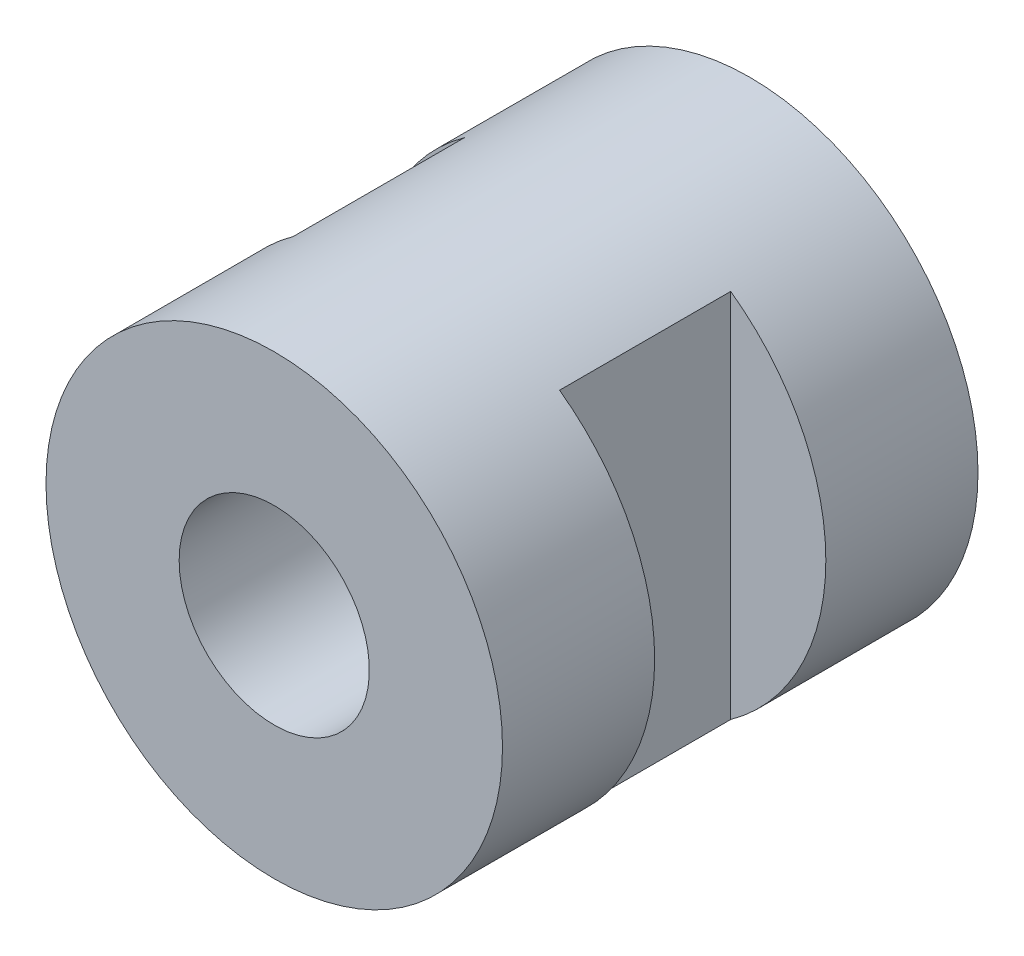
ISO-10303-21;
HEADER;
FILE_DESCRIPTION(('STEP AP214'),'2;1');
FILE_NAME('part.step','',(''),(''),'','','');
FILE_SCHEMA(('AUTOMOTIVE_DESIGN { 1 0 10303 214 1 1 1 1 }'));
ENDSEC;
DATA;
#1=APPLICATION_CONTEXT('core data for automotive mechanical design processes');
#2=APPLICATION_PROTOCOL_DEFINITION('international standard','automotive_design',2000,#1);
#3=PRODUCT_CONTEXT('',#1,'mechanical');
#4=PRODUCT('Part','Part','',(#3));
#5=PRODUCT_RELATED_PRODUCT_CATEGORY('part','',(#4));
#6=PRODUCT_DEFINITION_FORMATION('','',#4);
#7=PRODUCT_DEFINITION_CONTEXT('part definition',#1,'design');
#8=PRODUCT_DEFINITION('design','',#6,#7);
#9=PRODUCT_DEFINITION_SHAPE('','',#8);
#10=(LENGTH_UNIT() NAMED_UNIT(*) SI_UNIT(.MILLI.,.METRE.));
#11=(NAMED_UNIT(*) PLANE_ANGLE_UNIT() SI_UNIT($,.RADIAN.));
#12=(NAMED_UNIT(*) SI_UNIT($,.STERADIAN.) SOLID_ANGLE_UNIT());
#13=UNCERTAINTY_MEASURE_WITH_UNIT(LENGTH_MEASURE(1.E-05),#10,'distance_accuracy_value','');
#14=(GEOMETRIC_REPRESENTATION_CONTEXT(3) GLOBAL_UNCERTAINTY_ASSIGNED_CONTEXT((#13)) GLOBAL_UNIT_ASSIGNED_CONTEXT((#10,
#11,#12)) REPRESENTATION_CONTEXT('',''));
#15=CARTESIAN_POINT('',(0.,0.,0.));
#16=DIRECTION('',(0.,0.,1.));
#17=DIRECTION('',(1.,0.,0.));
#18=AXIS2_PLACEMENT_3D('',#15,#16,#17);
#19=CARTESIAN_POINT('',(0.,0.,12.5));
#20=DIRECTION('',(0.,0.,-1.));
#21=DIRECTION('',(-1.,0.,0.));
#22=AXIS2_PLACEMENT_3D('',#19,#20,#21);
#23=CYLINDRICAL_SURFACE('',#22,6.);
#24=DIRECTION('',(0.,0.,-1.));
#25=VECTOR('',#24,1.);
#26=CARTESIAN_POINT('',(-3.5,-4.87339717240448,12.5));
#27=LINE('',#26,#25);
#28=CARTESIAN_POINT('',(-3.5,-4.87339717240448,8.5));
#29=VERTEX_POINT('',#28);
#30=CARTESIAN_POINT('',(-3.5,-4.87339717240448,4.));
#31=VERTEX_POINT('',#30);
#32=EDGE_CURVE('E39',#29,#31,#27,.T.);
#33=ORIENTED_EDGE('',*,*,#32,.T.);
#34=CARTESIAN_POINT('',(0.,0.,4.));
#35=DIRECTION('',(0.,0.,-1.));
#36=DIRECTION('',(-1.,0.,0.));
#37=AXIS2_PLACEMENT_3D('',#34,#35,#36);
#38=CIRCLE('',#37,6.);
#39=CARTESIAN_POINT('',(-3.5,4.87339717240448,4.));
#40=VERTEX_POINT('',#39);
#41=EDGE_CURVE('E11',#31,#40,#38,.T.);
#42=ORIENTED_EDGE('',*,*,#41,.T.);
#43=DIRECTION('',(0.,0.,-1.));
#44=VECTOR('',#43,1.);
#45=CARTESIAN_POINT('',(-3.5,4.87339717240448,12.5));
#46=LINE('',#45,#44);
#47=CARTESIAN_POINT('',(-3.5,4.87339717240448,8.5));
#48=VERTEX_POINT('',#47);
#49=EDGE_CURVE('E75',#40,#48,#46,.F.);
#50=ORIENTED_EDGE('',*,*,#49,.T.);
#51=CARTESIAN_POINT('',(0.,0.,8.5));
#52=DIRECTION('',(0.,0.,1.));
#53=DIRECTION('',(1.,0.,0.));
#54=AXIS2_PLACEMENT_3D('',#51,#52,#53);
#55=CIRCLE('',#54,6.);
#56=EDGE_CURVE('E70',#48,#29,#55,.T.);
#57=ORIENTED_EDGE('',*,*,#56,.T.);
#58=EDGE_LOOP('',(#33,#42,#50,#57));
#59=FACE_BOUND('',#58,.T.);
#60=DIRECTION('',(0.,0.,-1.));
#61=VECTOR('',#60,1.);
#62=CARTESIAN_POINT('',(3.5,-4.87339717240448,12.5));
#63=LINE('',#62,#61);
#64=CARTESIAN_POINT('',(3.5,-4.87339717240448,4.));
#65=VERTEX_POINT('',#64);
#66=CARTESIAN_POINT('',(3.5,-4.87339717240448,8.5));
#67=VERTEX_POINT('',#66);
#68=EDGE_CURVE('E93',#65,#67,#63,.F.);
#69=ORIENTED_EDGE('',*,*,#68,.T.);
#70=CARTESIAN_POINT('',(0.,0.,8.5));
#71=DIRECTION('',(0.,0.,1.));
#72=DIRECTION('',(1.,0.,0.));
#73=AXIS2_PLACEMENT_3D('',#70,#71,#72);
#74=CIRCLE('',#73,6.);
#75=CARTESIAN_POINT('',(3.5,4.87339717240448,8.5));
#76=VERTEX_POINT('',#75);
#77=EDGE_CURVE('E76',#67,#76,#74,.T.);
#78=ORIENTED_EDGE('',*,*,#77,.T.);
#79=DIRECTION('',(0.,0.,-1.));
#80=VECTOR('',#79,1.);
#81=CARTESIAN_POINT('',(3.5,4.87339717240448,12.5));
#82=LINE('',#81,#80);
#83=CARTESIAN_POINT('',(3.5,4.87339717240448,4.));
#84=VERTEX_POINT('',#83);
#85=EDGE_CURVE('E90',#76,#84,#82,.T.);
#86=ORIENTED_EDGE('',*,*,#85,.T.);
#87=CARTESIAN_POINT('',(0.,0.,4.));
#88=DIRECTION('',(0.,0.,-1.));
#89=DIRECTION('',(-1.,0.,0.));
#90=AXIS2_PLACEMENT_3D('',#87,#88,#89);
#91=CIRCLE('',#90,6.);
#92=EDGE_CURVE('E96',#84,#65,#91,.T.);
#93=ORIENTED_EDGE('',*,*,#92,.T.);
#94=EDGE_LOOP('',(#69,#78,#86,#93));
#95=FACE_BOUND('',#94,.T.);
#96=CARTESIAN_POINT('',(0.,0.,12.5));
#97=DIRECTION('',(0.,0.,1.));
#98=DIRECTION('',(1.,0.,0.));
#99=AXIS2_PLACEMENT_3D('',#96,#97,#98);
#100=CIRCLE('',#99,6.);
#101=CARTESIAN_POINT('',(6.,0.,12.5));
#102=VERTEX_POINT('',#101);
#103=EDGE_CURVE('E99',#102,#102,#100,.T.);
#104=ORIENTED_EDGE('',*,*,#103,.F.);
#105=EDGE_LOOP('',(#104));
#106=FACE_BOUND('',#105,.T.);
#107=CARTESIAN_POINT('',(0.,0.,0.));
#108=DIRECTION('',(0.,0.,1.));
#109=DIRECTION('',(1.,0.,0.));
#110=AXIS2_PLACEMENT_3D('',#107,#108,#109);
#111=CIRCLE('',#110,6.);
#112=CARTESIAN_POINT('',(6.,0.,0.));
#113=VERTEX_POINT('',#112);
#114=EDGE_CURVE('E100',#113,#113,#111,.T.);
#115=ORIENTED_EDGE('',*,*,#114,.T.);
#116=EDGE_LOOP('',(#115));
#117=FACE_BOUND('',#116,.T.);
#118=ADVANCED_FACE('F32',(#59,#95,#106,#117),#23,.T.);
#119=CARTESIAN_POINT('',(0.,0.,12.5));
#120=DIRECTION('',(0.,0.,1.));
#121=DIRECTION('',(1.,0.,0.));
#122=AXIS2_PLACEMENT_3D('',#119,#120,#121);
#123=PLANE('',#122);
#124=CARTESIAN_POINT('',(0.,0.,12.5));
#125=DIRECTION('',(0.,0.,-1.));
#126=DIRECTION('',(-1.,0.,0.));
#127=AXIS2_PLACEMENT_3D('',#124,#125,#126);
#128=CIRCLE('',#127,2.5);
#129=CARTESIAN_POINT('',(-2.5,0.,12.5));
#130=VERTEX_POINT('',#129);
#131=EDGE_CURVE('E83',#130,#130,#128,.T.);
#132=ORIENTED_EDGE('',*,*,#131,.T.);
#133=EDGE_LOOP('',(#132));
#134=FACE_BOUND('',#133,.T.);
#135=ORIENTED_EDGE('',*,*,#103,.T.);
#136=EDGE_LOOP('',(#135));
#137=FACE_BOUND('',#136,.T.);
#138=ADVANCED_FACE('F116',(#134,#137),#123,.T.);
#139=CARTESIAN_POINT('',(0.,0.,0.));
#140=DIRECTION('',(0.,0.,1.));
#141=DIRECTION('',(1.,0.,0.));
#142=AXIS2_PLACEMENT_3D('',#139,#140,#141);
#143=PLANE('',#142);
#144=CARTESIAN_POINT('',(0.,0.,0.));
#145=DIRECTION('',(0.,0.,-1.));
#146=DIRECTION('',(-1.,0.,0.));
#147=AXIS2_PLACEMENT_3D('',#144,#145,#146);
#148=CIRCLE('',#147,2.5);
#149=CARTESIAN_POINT('',(-2.5,0.,0.));
#150=VERTEX_POINT('',#149);
#151=EDGE_CURVE('E110',#150,#150,#148,.T.);
#152=ORIENTED_EDGE('',*,*,#151,.F.);
#153=EDGE_LOOP('',(#152));
#154=FACE_BOUND('',#153,.T.);
#155=ORIENTED_EDGE('',*,*,#114,.F.);
#156=EDGE_LOOP('',(#155));
#157=FACE_BOUND('',#156,.T.);
#158=ADVANCED_FACE('F125',(#154,#157),#143,.F.);
#159=CARTESIAN_POINT('',(6.69448187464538,-6.,8.5));
#160=DIRECTION('',(0.,0.,1.));
#161=DIRECTION('',(1.,0.,0.));
#162=AXIS2_PLACEMENT_3D('',#159,#160,#161);
#163=PLANE('',#162);
#164=DIRECTION('',(0.,1.,0.));
#165=VECTOR('',#164,1.);
#166=CARTESIAN_POINT('',(3.5,-6.,8.5));
#167=LINE('',#166,#165);
#168=EDGE_CURVE('E103',#67,#76,#167,.T.);
#169=ORIENTED_EDGE('',*,*,#168,.T.);
#170=ORIENTED_EDGE('',*,*,#77,.F.);
#171=EDGE_LOOP('',(#169,#170));
#172=FACE_BOUND('',#171,.T.);
#173=ADVANCED_FACE('F128',(#172),#163,.F.);
#174=CARTESIAN_POINT('',(3.5,-6.,8.5));
#175=DIRECTION('',(-1.,0.,0.));
#176=DIRECTION('',(0.,0.,1.));
#177=AXIS2_PLACEMENT_3D('',#174,#175,#176);
#178=PLANE('',#177);
#179=ORIENTED_EDGE('',*,*,#168,.F.);
#180=ORIENTED_EDGE('',*,*,#68,.F.);
#181=DIRECTION('',(0.,1.,0.));
#182=VECTOR('',#181,1.);
#183=CARTESIAN_POINT('',(3.5,-6.,4.));
#184=LINE('',#183,#182);
#185=EDGE_CURVE('E52',#65,#84,#184,.T.);
#186=ORIENTED_EDGE('',*,*,#185,.T.);
#187=ORIENTED_EDGE('',*,*,#85,.F.);
#188=EDGE_LOOP('',(#179,#180,#186,#187));
#189=FACE_BOUND('',#188,.T.);
#190=ADVANCED_FACE('F143',(#189),#178,.F.);
#191=CARTESIAN_POINT('',(6.69448187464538,-6.,4.));
#192=DIRECTION('',(0.,0.,-1.));
#193=DIRECTION('',(-1.,0.,0.));
#194=AXIS2_PLACEMENT_3D('',#191,#192,#193);
#195=PLANE('',#194);
#196=ORIENTED_EDGE('',*,*,#185,.F.);
#197=ORIENTED_EDGE('',*,*,#92,.F.);
#198=EDGE_LOOP('',(#196,#197));
#199=FACE_BOUND('',#198,.T.);
#200=ADVANCED_FACE('F139',(#199),#195,.F.);
#201=CARTESIAN_POINT('',(-6.69448187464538,-6.,4.));
#202=DIRECTION('',(0.,0.,-1.));
#203=DIRECTION('',(-1.,0.,0.));
#204=AXIS2_PLACEMENT_3D('',#201,#202,#203);
#205=PLANE('',#204);
#206=DIRECTION('',(0.,1.,0.));
#207=VECTOR('',#206,1.);
#208=CARTESIAN_POINT('',(-3.5,-6.,4.));
#209=LINE('',#208,#207);
#210=EDGE_CURVE('E82',#31,#40,#209,.T.);
#211=ORIENTED_EDGE('',*,*,#210,.T.);
#212=ORIENTED_EDGE('',*,*,#41,.F.);
#213=EDGE_LOOP('',(#211,#212));
#214=FACE_BOUND('',#213,.T.);
#215=ADVANCED_FACE('F142',(#214),#205,.F.);
#216=CARTESIAN_POINT('',(-3.5,-6.,8.5));
#217=DIRECTION('',(1.,0.,0.));
#218=DIRECTION('',(0.,0.,-1.));
#219=AXIS2_PLACEMENT_3D('',#216,#217,#218);
#220=PLANE('',#219);
#221=DIRECTION('',(0.,1.,0.));
#222=VECTOR('',#221,1.);
#223=CARTESIAN_POINT('',(-3.5,-6.,8.5));
#224=LINE('',#223,#222);
#225=EDGE_CURVE('E45',#29,#48,#224,.T.);
#226=ORIENTED_EDGE('',*,*,#225,.T.);
#227=ORIENTED_EDGE('',*,*,#49,.F.);
#228=ORIENTED_EDGE('',*,*,#210,.F.);
#229=ORIENTED_EDGE('',*,*,#32,.F.);
#230=EDGE_LOOP('',(#226,#227,#228,#229));
#231=FACE_BOUND('',#230,.T.);
#232=ADVANCED_FACE('F79',(#231),#220,.F.);
#233=CARTESIAN_POINT('',(-6.69448187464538,-6.,8.5));
#234=DIRECTION('',(0.,0.,1.));
#235=DIRECTION('',(1.,0.,0.));
#236=AXIS2_PLACEMENT_3D('',#233,#234,#235);
#237=PLANE('',#236);
#238=ORIENTED_EDGE('',*,*,#225,.F.);
#239=ORIENTED_EDGE('',*,*,#56,.F.);
#240=EDGE_LOOP('',(#238,#239));
#241=FACE_BOUND('',#240,.T.);
#242=ADVANCED_FACE('F71',(#241),#237,.F.);
#243=CARTESIAN_POINT('',(0.,0.,12.5));
#244=DIRECTION('',(0.,0.,-1.));
#245=DIRECTION('',(-1.,0.,0.));
#246=AXIS2_PLACEMENT_3D('',#243,#244,#245);
#247=CYLINDRICAL_SURFACE('',#246,2.5);
#248=ORIENTED_EDGE('',*,*,#131,.F.);
#249=EDGE_LOOP('',(#248));
#250=FACE_BOUND('',#249,.T.);
#251=ORIENTED_EDGE('',*,*,#151,.T.);
#252=EDGE_LOOP('',(#251));
#253=FACE_BOUND('',#252,.T.);
#254=ADVANCED_FACE('F119',(#250,#253),#247,.F.);
#255=CLOSED_SHELL('',(#118,#138,#158,#173,#190,#200,#215,#232,#242,#254));
#256=MANIFOLD_SOLID_BREP('B2',#255);
#257=ADVANCED_BREP_SHAPE_REPRESENTATION('',(#18,#256),#14);
#258=SHAPE_DEFINITION_REPRESENTATION(#9,#257);
ENDSEC;
END-ISO-10303-21;
